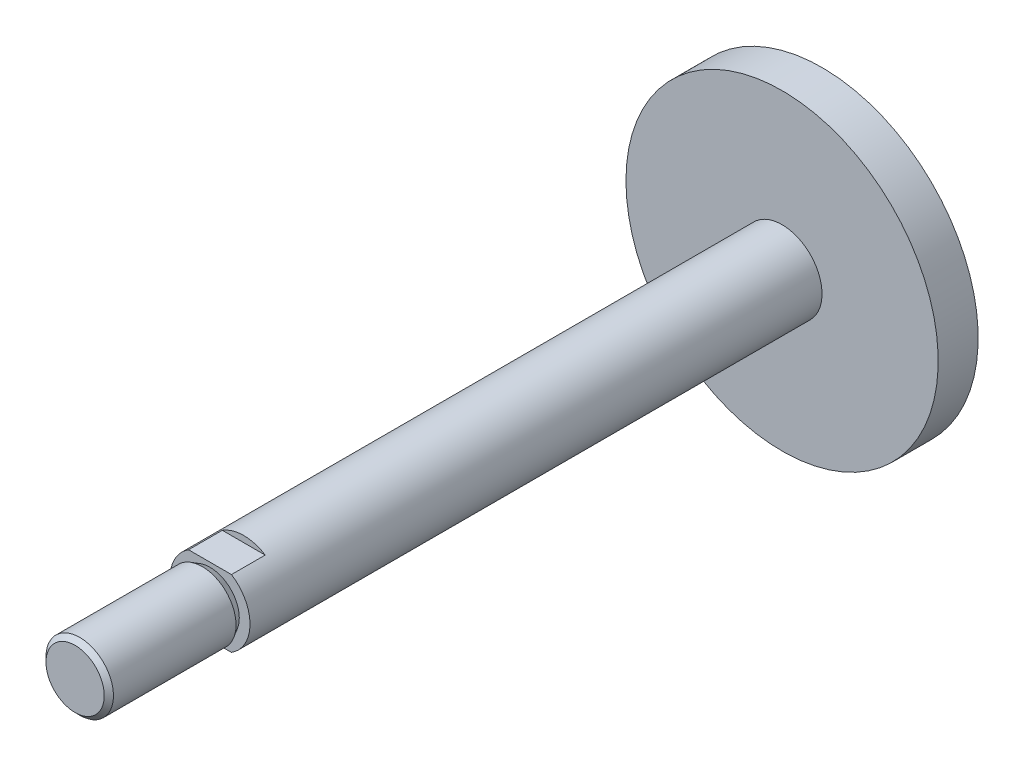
ISO-10303-21;
HEADER;
FILE_DESCRIPTION(('STEP AP214'),'2;1');
FILE_NAME('part.step','',(''),(''),'','','');
FILE_SCHEMA(('AUTOMOTIVE_DESIGN { 1 0 10303 214 1 1 1 1 }'));
ENDSEC;
DATA;
#1=APPLICATION_CONTEXT('core data for automotive mechanical design processes');
#2=APPLICATION_PROTOCOL_DEFINITION('international standard','automotive_design',2000,#1);
#3=PRODUCT_CONTEXT('',#1,'mechanical');
#4=PRODUCT('Part','Part','',(#3));
#5=PRODUCT_RELATED_PRODUCT_CATEGORY('part','',(#4));
#6=PRODUCT_DEFINITION_FORMATION('','',#4);
#7=PRODUCT_DEFINITION_CONTEXT('part definition',#1,'design');
#8=PRODUCT_DEFINITION('design','',#6,#7);
#9=PRODUCT_DEFINITION_SHAPE('','',#8);
#10=(LENGTH_UNIT() NAMED_UNIT(*) SI_UNIT(.MILLI.,.METRE.));
#11=(NAMED_UNIT(*) PLANE_ANGLE_UNIT() SI_UNIT($,.RADIAN.));
#12=(NAMED_UNIT(*) SI_UNIT($,.STERADIAN.) SOLID_ANGLE_UNIT());
#13=UNCERTAINTY_MEASURE_WITH_UNIT(LENGTH_MEASURE(1.E-05),#10,'distance_accuracy_value','');
#14=(GEOMETRIC_REPRESENTATION_CONTEXT(3) GLOBAL_UNCERTAINTY_ASSIGNED_CONTEXT((#13)) GLOBAL_UNIT_ASSIGNED_CONTEXT((#10,
#11,#12)) REPRESENTATION_CONTEXT('',''));
#15=CARTESIAN_POINT('',(0.,0.,0.));
#16=DIRECTION('',(0.,0.,1.));
#17=DIRECTION('',(1.,0.,0.));
#18=AXIS2_PLACEMENT_3D('',#15,#16,#17);
#19=CARTESIAN_POINT('',(0.,5.82975,119.));
#20=DIRECTION('',(0.,0.,1.));
#21=DIRECTION('',(1.,0.,0.));
#22=AXIS2_PLACEMENT_3D('',#19,#20,#21);
#23=PLANE('',#22);
#24=CARTESIAN_POINT('',(0.,0.,119.));
#25=DIRECTION('',(0.,0.,-1.));
#26=DIRECTION('',(-1.,0.,0.));
#27=AXIS2_PLACEMENT_3D('',#24,#25,#26);
#28=CIRCLE('',#27,11.6595);
#29=CARTESIAN_POINT('',(-11.6595,0.,119.));
#30=VERTEX_POINT('',#29);
#31=EDGE_CURVE('E19',#30,#30,#28,.T.);
#32=ORIENTED_EDGE('',*,*,#31,.F.);
#33=EDGE_LOOP('',(#32));
#34=FACE_BOUND('',#33,.T.);
#35=ADVANCED_FACE('F16',(#34),#23,.T.);
#36=CARTESIAN_POINT('',(0.,0.,117.1595));
#37=DIRECTION('',(0.,0.,-1.));
#38=DIRECTION('',(-1.,0.,0.));
#39=AXIS2_PLACEMENT_3D('',#36,#37,#38);
#40=CONICAL_SURFACE('',#39,13.5,0.785398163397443);
#41=ORIENTED_EDGE('',*,*,#31,.T.);
#42=EDGE_LOOP('',(#41));
#43=FACE_BOUND('',#42,.T.);
#44=CARTESIAN_POINT('',(0.,0.,117.1595));
#45=DIRECTION('',(0.,0.,-1.));
#46=DIRECTION('',(-1.,0.,0.));
#47=AXIS2_PLACEMENT_3D('',#44,#45,#46);
#48=CIRCLE('',#47,13.5);
#49=CARTESIAN_POINT('',(-13.5,0.,117.1595));
#50=VERTEX_POINT('',#49);
#51=EDGE_CURVE('E93',#50,#50,#48,.T.);
#52=ORIENTED_EDGE('',*,*,#51,.F.);
#53=EDGE_LOOP('',(#52));
#54=FACE_BOUND('',#53,.T.);
#55=ADVANCED_FACE('F193',(#43,#54),#40,.T.);
#56=CARTESIAN_POINT('',(0.,0.,92.6236697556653));
#57=DIRECTION('',(0.,0.,-1.));
#58=DIRECTION('',(-1.,0.,0.));
#59=AXIS2_PLACEMENT_3D('',#56,#57,#58);
#60=CYLINDRICAL_SURFACE('',#59,13.5);
#61=ORIENTED_EDGE('',*,*,#51,.T.);
#62=EDGE_LOOP('',(#61));
#63=FACE_BOUND('',#62,.T.);
#64=CARTESIAN_POINT('',(0.,0.,68.0878395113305));
#65=DIRECTION('',(0.,0.,1.));
#66=DIRECTION('',(0.,1.,0.));
#67=AXIS2_PLACEMENT_3D('',#64,#65,#66);
#68=CIRCLE('',#67,13.5);
#69=CARTESIAN_POINT('',(0.,13.5,68.0878395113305));
#70=VERTEX_POINT('',#69);
#71=EDGE_CURVE('E89',#70,#70,#68,.F.);
#72=ORIENTED_EDGE('',*,*,#71,.F.);
#73=EDGE_LOOP('',(#72));
#74=FACE_BOUND('',#73,.T.);
#75=ADVANCED_FACE('F119',(#63,#74),#60,.T.);
#76=CARTESIAN_POINT('',(0.,0.,68.0878395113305));
#77=DIRECTION('',(0.,0.,1.));
#78=DIRECTION('',(1.,0.,0.));
#79=AXIS2_PLACEMENT_3D('',#76,#77,#78);
#80=CONICAL_SURFACE('',#79,13.5,0.523598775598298);
#81=ORIENTED_EDGE('',*,*,#71,.T.);
#82=EDGE_LOOP('',(#81));
#83=FACE_BOUND('',#82,.T.);
#84=CARTESIAN_POINT('',(0.,0.,64.9999999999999));
#85=DIRECTION('',(0.,0.,1.));
#86=DIRECTION('',(1.,0.,0.));
#87=AXIS2_PLACEMENT_3D('',#84,#85,#86);
#88=CIRCLE('',#87,11.717235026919);
#89=CARTESIAN_POINT('',(11.717235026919,0.,64.9999999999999));
#90=VERTEX_POINT('',#89);
#91=EDGE_CURVE('E68',#90,#90,#88,.F.);
#92=ORIENTED_EDGE('',*,*,#91,.F.);
#93=EDGE_LOOP('',(#92));
#94=FACE_BOUND('',#93,.T.);
#95=ADVANCED_FACE('F111',(#83,#94),#80,.T.);
#96=CARTESIAN_POINT('',(0.,0.,51.5));
#97=DIRECTION('',(0.,0.,1.));
#98=DIRECTION('',(1.,0.,0.));
#99=AXIS2_PLACEMENT_3D('',#96,#97,#98);
#100=PLANE('',#99);
#101=DIRECTION('',(1.,0.,0.));
#102=VECTOR('',#101,1.);
#103=CARTESIAN_POINT('',(-32.,13.5,51.5));
#104=LINE('',#103,#102);
#105=CARTESIAN_POINT('',(-8.58778201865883,13.5,51.5));
#106=VERTEX_POINT('',#105);
#107=CARTESIAN_POINT('',(8.58778201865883,13.5,51.5));
#108=VERTEX_POINT('',#107);
#109=EDGE_CURVE('E74',#106,#108,#104,.T.);
#110=ORIENTED_EDGE('',*,*,#109,.T.);
#111=CARTESIAN_POINT('',(0.,0.,51.5));
#112=DIRECTION('',(0.,0.,-1.));
#113=DIRECTION('',(-1.,0.,0.));
#114=AXIS2_PLACEMENT_3D('',#111,#112,#113);
#115=CIRCLE('',#114,16.);
#116=EDGE_CURVE('E77',#106,#108,#115,.T.);
#117=ORIENTED_EDGE('',*,*,#116,.F.);
#118=EDGE_LOOP('',(#110,#117));
#119=FACE_BOUND('',#118,.T.);
#120=ADVANCED_FACE('F109',(#119),#100,.T.);
#121=CARTESIAN_POINT('',(-32.,13.5,78.5));
#122=DIRECTION('',(0.,-1.,0.));
#123=DIRECTION('',(0.,0.,-1.));
#124=AXIS2_PLACEMENT_3D('',#121,#122,#123);
#125=PLANE('',#124);
#126=DIRECTION('',(1.,0.,0.));
#127=VECTOR('',#126,1.);
#128=CARTESIAN_POINT('',(0.,13.5,64.9999999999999));
#129=LINE('',#128,#127);
#130=CARTESIAN_POINT('',(8.58778201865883,13.5,64.9999999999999));
#131=VERTEX_POINT('',#130);
#132=CARTESIAN_POINT('',(-8.58778201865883,13.5,64.9999999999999));
#133=VERTEX_POINT('',#132);
#134=EDGE_CURVE('E55',#131,#133,#129,.F.);
#135=ORIENTED_EDGE('',*,*,#134,.F.);
#136=DIRECTION('',(0.,0.,-1.));
#137=VECTOR('',#136,1.);
#138=CARTESIAN_POINT('',(8.58778201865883,13.5,-57.45));
#139=LINE('',#138,#137);
#140=EDGE_CURVE('E96',#108,#131,#139,.F.);
#141=ORIENTED_EDGE('',*,*,#140,.F.);
#142=ORIENTED_EDGE('',*,*,#109,.F.);
#143=DIRECTION('',(0.,0.,-1.));
#144=VECTOR('',#143,1.);
#145=CARTESIAN_POINT('',(-8.58778201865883,13.5,-57.45));
#146=LINE('',#145,#144);
#147=EDGE_CURVE('E72',#133,#106,#146,.T.);
#148=ORIENTED_EDGE('',*,*,#147,.F.);
#149=EDGE_LOOP('',(#135,#141,#142,#148));
#150=FACE_BOUND('',#149,.T.);
#151=ADVANCED_FACE('F73',(#150),#125,.F.);
#152=CARTESIAN_POINT('',(0.,8.,64.9999999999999));
#153=DIRECTION('',(0.,0.,1.));
#154=DIRECTION('',(1.,0.,0.));
#155=AXIS2_PLACEMENT_3D('',#152,#153,#154);
#156=PLANE('',#155);
#157=ORIENTED_EDGE('',*,*,#134,.T.);
#158=CARTESIAN_POINT('',(0.,0.,64.9999999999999));
#159=DIRECTION('',(0.,0.,-1.));
#160=DIRECTION('',(-1.,0.,0.));
#161=AXIS2_PLACEMENT_3D('',#158,#159,#160);
#162=CIRCLE('',#161,16.);
#163=CARTESIAN_POINT('',(-8.58778201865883,-13.5,64.9999999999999));
#164=VERTEX_POINT('',#163);
#165=EDGE_CURVE('E60',#164,#133,#162,.T.);
#166=ORIENTED_EDGE('',*,*,#165,.F.);
#167=DIRECTION('',(1.,0.,0.));
#168=VECTOR('',#167,1.);
#169=CARTESIAN_POINT('',(32.,-13.5,64.9999999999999));
#170=LINE('',#169,#168);
#171=CARTESIAN_POINT('',(8.58778201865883,-13.5,64.9999999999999));
#172=VERTEX_POINT('',#171);
#173=EDGE_CURVE('E67',#164,#172,#170,.T.);
#174=ORIENTED_EDGE('',*,*,#173,.T.);
#175=CARTESIAN_POINT('',(0.,0.,64.9999999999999));
#176=DIRECTION('',(0.,0.,-1.));
#177=DIRECTION('',(-1.,0.,0.));
#178=AXIS2_PLACEMENT_3D('',#175,#176,#177);
#179=CIRCLE('',#178,16.);
#180=EDGE_CURVE('E63',#131,#172,#179,.T.);
#181=ORIENTED_EDGE('',*,*,#180,.F.);
#182=EDGE_LOOP('',(#157,#166,#174,#181));
#183=FACE_BOUND('',#182,.T.);
#184=ORIENTED_EDGE('',*,*,#91,.T.);
#185=EDGE_LOOP('',(#184));
#186=FACE_BOUND('',#185,.T.);
#187=ADVANCED_FACE('F57',(#183,#186),#156,.T.);
#188=CARTESIAN_POINT('',(32.,-13.5,78.5));
#189=DIRECTION('',(0.,1.,0.));
#190=DIRECTION('',(0.,0.,1.));
#191=AXIS2_PLACEMENT_3D('',#188,#189,#190);
#192=PLANE('',#191);
#193=DIRECTION('',(1.,0.,0.));
#194=VECTOR('',#193,1.);
#195=CARTESIAN_POINT('',(0.,-13.5,51.5));
#196=LINE('',#195,#194);
#197=CARTESIAN_POINT('',(8.58778201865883,-13.5,51.5));
#198=VERTEX_POINT('',#197);
#199=CARTESIAN_POINT('',(-8.58778201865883,-13.5,51.5));
#200=VERTEX_POINT('',#199);
#201=EDGE_CURVE('E34',#198,#200,#196,.F.);
#202=ORIENTED_EDGE('',*,*,#201,.F.);
#203=DIRECTION('',(0.,0.,-1.));
#204=VECTOR('',#203,1.);
#205=CARTESIAN_POINT('',(8.58778201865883,-13.5,-57.45));
#206=LINE('',#205,#204);
#207=EDGE_CURVE('E106',#172,#198,#206,.T.);
#208=ORIENTED_EDGE('',*,*,#207,.F.);
#209=ORIENTED_EDGE('',*,*,#173,.F.);
#210=DIRECTION('',(0.,0.,-1.));
#211=VECTOR('',#210,1.);
#212=CARTESIAN_POINT('',(-8.58778201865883,-13.5,-57.45));
#213=LINE('',#212,#211);
#214=EDGE_CURVE('E82',#200,#164,#213,.F.);
#215=ORIENTED_EDGE('',*,*,#214,.F.);
#216=EDGE_LOOP('',(#202,#208,#209,#215));
#217=FACE_BOUND('',#216,.T.);
#218=ADVANCED_FACE('F142',(#217),#192,.F.);
#219=CARTESIAN_POINT('',(0.,0.,51.5));
#220=DIRECTION('',(0.,0.,1.));
#221=DIRECTION('',(1.,0.,0.));
#222=AXIS2_PLACEMENT_3D('',#219,#220,#221);
#223=PLANE('',#222);
#224=ORIENTED_EDGE('',*,*,#201,.T.);
#225=CARTESIAN_POINT('',(0.,0.,51.5));
#226=DIRECTION('',(0.,0.,-1.));
#227=DIRECTION('',(-1.,0.,0.));
#228=AXIS2_PLACEMENT_3D('',#225,#226,#227);
#229=CIRCLE('',#228,16.);
#230=EDGE_CURVE('E105',#198,#200,#229,.T.);
#231=ORIENTED_EDGE('',*,*,#230,.F.);
#232=EDGE_LOOP('',(#224,#231));
#233=FACE_BOUND('',#232,.T.);
#234=ADVANCED_FACE('F139',(#233),#223,.T.);
#235=CARTESIAN_POINT('',(0.,0.,-57.45));
#236=DIRECTION('',(0.,0.,-1.));
#237=DIRECTION('',(-1.,0.,0.));
#238=AXIS2_PLACEMENT_3D('',#235,#236,#237);
#239=CYLINDRICAL_SURFACE('',#238,16.);
#240=ORIENTED_EDGE('',*,*,#147,.T.);
#241=ORIENTED_EDGE('',*,*,#116,.T.);
#242=ORIENTED_EDGE('',*,*,#140,.T.);
#243=ORIENTED_EDGE('',*,*,#180,.T.);
#244=ORIENTED_EDGE('',*,*,#207,.T.);
#245=ORIENTED_EDGE('',*,*,#230,.T.);
#246=ORIENTED_EDGE('',*,*,#214,.T.);
#247=ORIENTED_EDGE('',*,*,#165,.T.);
#248=EDGE_LOOP('',(#240,#241,#242,#243,#244,#245,#246,#247));
#249=FACE_BOUND('',#248,.T.);
#250=CARTESIAN_POINT('',(0.,0.,-164.));
#251=DIRECTION('',(0.,0.,-1.));
#252=DIRECTION('',(-1.,0.,0.));
#253=AXIS2_PLACEMENT_3D('',#250,#251,#252);
#254=CIRCLE('',#253,16.);
#255=CARTESIAN_POINT('',(-16.,0.,-164.));
#256=VERTEX_POINT('',#255);
#257=EDGE_CURVE('E102',#256,#256,#254,.T.);
#258=ORIENTED_EDGE('',*,*,#257,.F.);
#259=EDGE_LOOP('',(#258));
#260=FACE_BOUND('',#259,.T.);
#261=ADVANCED_FACE('F79',(#249,#260),#239,.T.);
#262=CARTESIAN_POINT('',(0.,35.25,-164.));
#263=DIRECTION('',(0.,0.,1.));
#264=DIRECTION('',(1.,0.,0.));
#265=AXIS2_PLACEMENT_3D('',#262,#263,#264);
#266=PLANE('',#265);
#267=CARTESIAN_POINT('',(0.,0.,-164.));
#268=DIRECTION('',(0.,0.,-1.));
#269=DIRECTION('',(-1.,0.,0.));
#270=AXIS2_PLACEMENT_3D('',#267,#268,#269);
#271=CIRCLE('',#270,62.5);
#272=CARTESIAN_POINT('',(-62.5,0.,-164.));
#273=VERTEX_POINT('',#272);
#274=EDGE_CURVE('E25',#273,#273,#271,.T.);
#275=ORIENTED_EDGE('',*,*,#274,.F.);
#276=EDGE_LOOP('',(#275));
#277=FACE_BOUND('',#276,.T.);
#278=ORIENTED_EDGE('',*,*,#257,.T.);
#279=EDGE_LOOP('',(#278));
#280=FACE_BOUND('',#279,.T.);
#281=ADVANCED_FACE('F130',(#277,#280),#266,.T.);
#282=CARTESIAN_POINT('',(0.,0.,-172.));
#283=DIRECTION('',(0.,0.,-1.));
#284=DIRECTION('',(-1.,0.,0.));
#285=AXIS2_PLACEMENT_3D('',#282,#283,#284);
#286=CYLINDRICAL_SURFACE('',#285,62.5);
#287=ORIENTED_EDGE('',*,*,#274,.T.);
#288=EDGE_LOOP('',(#287));
#289=FACE_BOUND('',#288,.T.);
#290=CARTESIAN_POINT('',(0.,0.,-180.));
#291=DIRECTION('',(0.,0.,-1.));
#292=DIRECTION('',(-1.,0.,0.));
#293=AXIS2_PLACEMENT_3D('',#290,#291,#292);
#294=CIRCLE('',#293,62.5);
#295=CARTESIAN_POINT('',(-62.5,0.,-180.));
#296=VERTEX_POINT('',#295);
#297=EDGE_CURVE('E11',#296,#296,#294,.T.);
#298=ORIENTED_EDGE('',*,*,#297,.F.);
#299=EDGE_LOOP('',(#298));
#300=FACE_BOUND('',#299,.T.);
#301=ADVANCED_FACE('F124',(#289,#300),#286,.T.);
#302=CARTESIAN_POINT('',(0.,31.25,-180.));
#303=DIRECTION('',(0.,0.,-1.));
#304=DIRECTION('',(-1.,0.,0.));
#305=AXIS2_PLACEMENT_3D('',#302,#303,#304);
#306=PLANE('',#305);
#307=ORIENTED_EDGE('',*,*,#297,.T.);
#308=EDGE_LOOP('',(#307));
#309=FACE_BOUND('',#308,.T.);
#310=ADVANCED_FACE('F122',(#309),#306,.T.);
#311=CLOSED_SHELL('',(#35,#55,#75,#95,#120,#151,#187,#218,#234,#261,#281,#301,#310));
#312=MANIFOLD_SOLID_BREP('B1',#311);
#313=ADVANCED_BREP_SHAPE_REPRESENTATION('',(#18,#312),#14);
#314=SHAPE_DEFINITION_REPRESENTATION(#9,#313);
ENDSEC;
END-ISO-10303-21;
